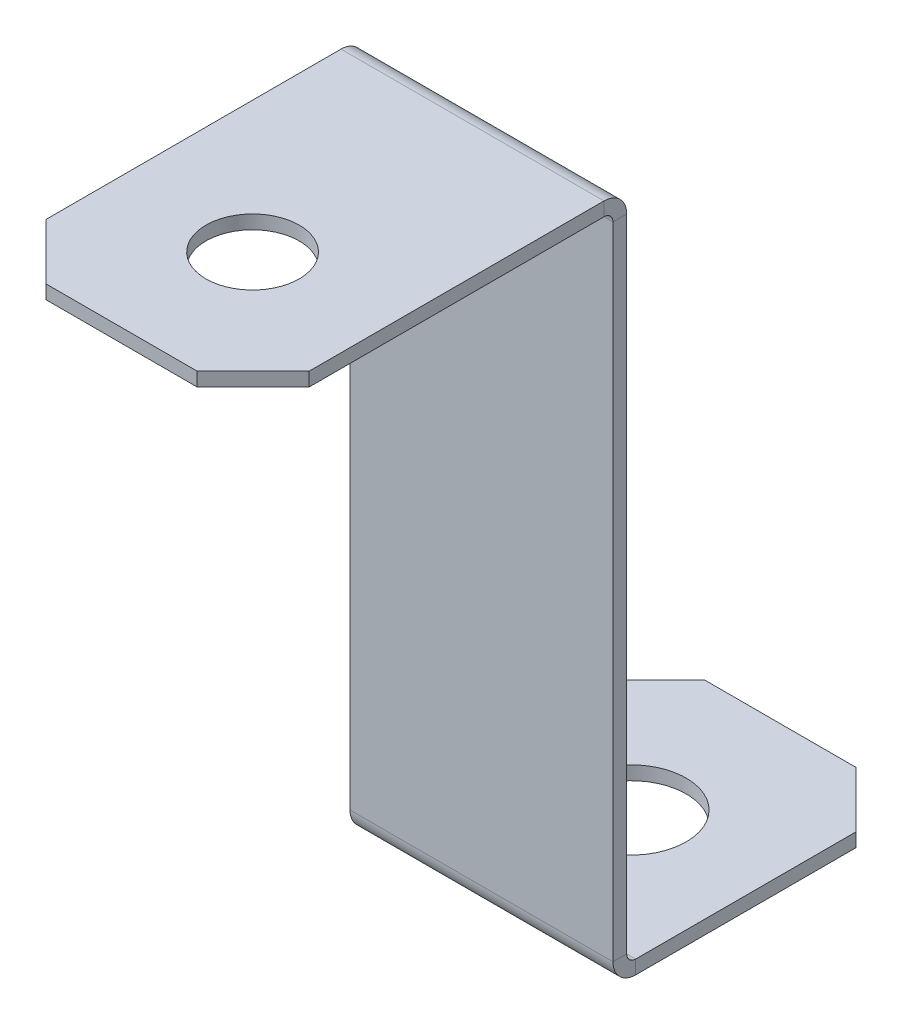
ISO-10303-21;
HEADER;
FILE_DESCRIPTION(('STEP AP214'),'2;1');
FILE_NAME('part.step','',(''),(''),'','','');
FILE_SCHEMA(('AUTOMOTIVE_DESIGN { 1 0 10303 214 1 1 1 1 }'));
ENDSEC;
DATA;
#1=APPLICATION_CONTEXT('core data for automotive mechanical design processes');
#2=APPLICATION_PROTOCOL_DEFINITION('international standard','automotive_design',2000,#1);
#3=PRODUCT_CONTEXT('',#1,'mechanical');
#4=PRODUCT('Part','Part','',(#3));
#5=PRODUCT_RELATED_PRODUCT_CATEGORY('part','',(#4));
#6=PRODUCT_DEFINITION_FORMATION('','',#4);
#7=PRODUCT_DEFINITION_CONTEXT('part definition',#1,'design');
#8=PRODUCT_DEFINITION('design','',#6,#7);
#9=PRODUCT_DEFINITION_SHAPE('','',#8);
#10=(LENGTH_UNIT() NAMED_UNIT(*) SI_UNIT(.MILLI.,.METRE.));
#11=(NAMED_UNIT(*) PLANE_ANGLE_UNIT() SI_UNIT($,.RADIAN.));
#12=(NAMED_UNIT(*) SI_UNIT($,.STERADIAN.) SOLID_ANGLE_UNIT());
#13=UNCERTAINTY_MEASURE_WITH_UNIT(LENGTH_MEASURE(1.E-05),#10,'distance_accuracy_value','');
#14=(GEOMETRIC_REPRESENTATION_CONTEXT(3) GLOBAL_UNCERTAINTY_ASSIGNED_CONTEXT((#13)) GLOBAL_UNIT_ASSIGNED_CONTEXT((#10,
#11,#12)) REPRESENTATION_CONTEXT('',''));
#15=CARTESIAN_POINT('',(0.,0.,0.));
#16=DIRECTION('',(0.,0.,1.));
#17=DIRECTION('',(1.,0.,0.));
#18=AXIS2_PLACEMENT_3D('',#15,#16,#17);
#19=CARTESIAN_POINT('',(5.588,-0.9652,-10.3124));
#20=DIRECTION('',(1.,0.,0.));
#21=DIRECTION('',(0.,0.,-1.));
#22=AXIS2_PLACEMENT_3D('',#19,#20,#21);
#23=PLANE('',#22);
#24=DIRECTION('',(0.,0.,1.));
#25=VECTOR('',#24,1.);
#26=CARTESIAN_POINT('',(5.588,-0.9652,-10.3124));
#27=LINE('',#26,#25);
#28=CARTESIAN_POINT('',(5.588,-0.9652,-10.3124));
#29=VERTEX_POINT('',#28);
#30=CARTESIAN_POINT('',(5.588,-0.9652,-9.7282));
#31=VERTEX_POINT('',#30);
#32=EDGE_CURVE('E270',#29,#31,#27,.T.);
#33=ORIENTED_EDGE('',*,*,#32,.F.);
#34=CARTESIAN_POINT('',(5.588,-0.9652,-9.3472));
#35=DIRECTION('',(1.,0.,0.));
#36=DIRECTION('',(0.,0.,-1.));
#37=AXIS2_PLACEMENT_3D('',#34,#35,#36);
#38=CIRCLE('',#37,0.9652);
#39=CARTESIAN_POINT('',(5.588,0.,-9.3472));
#40=VERTEX_POINT('',#39);
#41=EDGE_CURVE('E187',#40,#29,#38,.F.);
#42=ORIENTED_EDGE('',*,*,#41,.F.);
#43=DIRECTION('',(0.,1.,0.));
#44=VECTOR('',#43,1.);
#45=CARTESIAN_POINT('',(5.588,-0.5842,-9.3472));
#46=LINE('',#45,#44);
#47=CARTESIAN_POINT('',(5.588,-0.5842,-9.3472));
#48=VERTEX_POINT('',#47);
#49=EDGE_CURVE('E267',#48,#40,#46,.T.);
#50=ORIENTED_EDGE('',*,*,#49,.F.);
#51=CARTESIAN_POINT('',(5.588,-0.9652,-9.3472));
#52=DIRECTION('',(1.,0.,0.));
#53=DIRECTION('',(0.,0.,-1.));
#54=AXIS2_PLACEMENT_3D('',#51,#52,#53);
#55=CIRCLE('',#54,0.381);
#56=EDGE_CURVE('E197',#48,#31,#55,.F.);
#57=ORIENTED_EDGE('',*,*,#56,.T.);
#58=EDGE_LOOP('',(#33,#42,#50,#57));
#59=FACE_BOUND('',#58,.T.);
#60=ADVANCED_FACE('F37',(#59),#23,.T.);
#61=CARTESIAN_POINT('',(5.588,-0.5842,-9.3472));
#62=DIRECTION('',(1.,0.,0.));
#63=DIRECTION('',(0.,0.,-1.));
#64=AXIS2_PLACEMENT_3D('',#61,#62,#63);
#65=PLANE('',#64);
#66=DIRECTION('',(0.,-1.,0.));
#67=VECTOR('',#66,1.);
#68=CARTESIAN_POINT('',(5.588,0.,-10.3124));
#69=LINE('',#68,#67);
#70=CARTESIAN_POINT('',(5.588,-28.194,-10.3124));
#71=VERTEX_POINT('',#70);
#72=EDGE_CURVE('E185',#29,#71,#69,.T.);
#73=ORIENTED_EDGE('',*,*,#72,.F.);
#74=ORIENTED_EDGE('',*,*,#32,.T.);
#75=DIRECTION('',(0.,-1.,0.));
#76=VECTOR('',#75,1.);
#77=CARTESIAN_POINT('',(5.588,0.,-9.7282));
#78=LINE('',#77,#76);
#79=CARTESIAN_POINT('',(5.588,-28.194,-9.7282));
#80=VERTEX_POINT('',#79);
#81=EDGE_CURVE('E200',#31,#80,#78,.T.);
#82=ORIENTED_EDGE('',*,*,#81,.T.);
#83=DIRECTION('',(0.,0.,-1.));
#84=VECTOR('',#83,1.);
#85=CARTESIAN_POINT('',(5.588,-28.194,-9.7282));
#86=LINE('',#85,#84);
#87=EDGE_CURVE('E162',#80,#71,#86,.T.);
#88=ORIENTED_EDGE('',*,*,#87,.T.);
#89=EDGE_LOOP('',(#73,#74,#82,#88));
#90=FACE_BOUND('',#89,.T.);
#91=ADVANCED_FACE('F347',(#90),#65,.T.);
#92=CARTESIAN_POINT('',(-5.588,0.,-9.3472));
#93=DIRECTION('',(-1.,0.,0.));
#94=DIRECTION('',(0.,0.,1.));
#95=AXIS2_PLACEMENT_3D('',#92,#93,#94);
#96=PLANE('',#95);
#97=DIRECTION('',(0.,-1.,0.));
#98=VECTOR('',#97,1.);
#99=CARTESIAN_POINT('',(-5.588,0.,-9.3472));
#100=LINE('',#99,#98);
#101=CARTESIAN_POINT('',(-5.588,0.,-9.3472));
#102=VERTEX_POINT('',#101);
#103=CARTESIAN_POINT('',(-5.588,-0.5842,-9.3472));
#104=VERTEX_POINT('',#103);
#105=EDGE_CURVE('E264',#102,#104,#100,.T.);
#106=ORIENTED_EDGE('',*,*,#105,.F.);
#107=CARTESIAN_POINT('',(-5.588,-0.9652,-9.3472));
#108=DIRECTION('',(1.,0.,0.));
#109=DIRECTION('',(0.,0.,-1.));
#110=AXIS2_PLACEMENT_3D('',#107,#108,#109);
#111=CIRCLE('',#110,0.9652);
#112=CARTESIAN_POINT('',(-5.588,-0.9652,-10.3124));
#113=VERTEX_POINT('',#112);
#114=EDGE_CURVE('E215',#102,#113,#111,.F.);
#115=ORIENTED_EDGE('',*,*,#114,.T.);
#116=DIRECTION('',(0.,0.,-1.));
#117=VECTOR('',#116,1.);
#118=CARTESIAN_POINT('',(-5.588,-0.9652,-9.7282));
#119=LINE('',#118,#117);
#120=CARTESIAN_POINT('',(-5.588,-0.9652,-9.7282));
#121=VERTEX_POINT('',#120);
#122=EDGE_CURVE('E161',#121,#113,#119,.T.);
#123=ORIENTED_EDGE('',*,*,#122,.F.);
#124=CARTESIAN_POINT('',(-5.588,-0.9652,-9.3472));
#125=DIRECTION('',(1.,0.,0.));
#126=DIRECTION('',(0.,0.,-1.));
#127=AXIS2_PLACEMENT_3D('',#124,#125,#126);
#128=CIRCLE('',#127,0.381);
#129=EDGE_CURVE('E222',#104,#121,#128,.F.);
#130=ORIENTED_EDGE('',*,*,#129,.F.);
#131=EDGE_LOOP('',(#106,#115,#123,#130));
#132=FACE_BOUND('',#131,.T.);
#133=ADVANCED_FACE('F353',(#132),#96,.T.);
#134=CARTESIAN_POINT('',(-5.588,-0.9652,-9.7282));
#135=DIRECTION('',(-1.,0.,0.));
#136=DIRECTION('',(0.,0.,1.));
#137=AXIS2_PLACEMENT_3D('',#134,#135,#136);
#138=PLANE('',#137);
#139=DIRECTION('',(0.,0.,-1.));
#140=VECTOR('',#139,1.);
#141=CARTESIAN_POINT('',(-5.588,-0.5842,5.5626));
#142=LINE('',#141,#140);
#143=CARTESIAN_POINT('',(-5.588,-0.5842,3.18135000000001));
#144=VERTEX_POINT('',#143);
#145=EDGE_CURVE('E220',#144,#104,#142,.T.);
#146=ORIENTED_EDGE('',*,*,#145,.F.);
#147=DIRECTION('',(0.,1.,0.));
#148=VECTOR('',#147,1.);
#149=CARTESIAN_POINT('',(-5.588,-0.9652,3.18135000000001));
#150=LINE('',#149,#148);
#151=CARTESIAN_POINT('',(-5.588,0.,3.18135000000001));
#152=VERTEX_POINT('',#151);
#153=EDGE_CURVE('E272',#144,#152,#150,.T.);
#154=ORIENTED_EDGE('',*,*,#153,.T.);
#155=DIRECTION('',(0.,0.,-1.));
#156=VECTOR('',#155,1.);
#157=CARTESIAN_POINT('',(-5.588,0.,5.5626));
#158=LINE('',#157,#156);
#159=EDGE_CURVE('E218',#152,#102,#158,.T.);
#160=ORIENTED_EDGE('',*,*,#159,.T.);
#161=ORIENTED_EDGE('',*,*,#105,.T.);
#162=EDGE_LOOP('',(#146,#154,#160,#161));
#163=FACE_BOUND('',#162,.T.);
#164=ADVANCED_FACE('F451',(#163),#138,.T.);
#165=CARTESIAN_POINT('',(5.588,-28.575,-10.6934));
#166=DIRECTION('',(1.,0.,0.));
#167=DIRECTION('',(0.,0.,-1.));
#168=AXIS2_PLACEMENT_3D('',#165,#166,#167);
#169=PLANE('',#168);
#170=DIRECTION('',(0.,-1.,0.));
#171=VECTOR('',#170,1.);
#172=CARTESIAN_POINT('',(5.588,-28.575,-10.6934));
#173=LINE('',#172,#171);
#174=CARTESIAN_POINT('',(5.588,-28.575,-10.6934));
#175=VERTEX_POINT('',#174);
#176=CARTESIAN_POINT('',(5.588,-29.1592,-10.6934));
#177=VERTEX_POINT('',#176);
#178=EDGE_CURVE('E152',#175,#177,#173,.T.);
#179=ORIENTED_EDGE('',*,*,#178,.F.);
#180=CARTESIAN_POINT('',(5.588,-28.194,-10.6934));
#181=DIRECTION('',(-1.,0.,0.));
#182=DIRECTION('',(0.,0.,1.));
#183=AXIS2_PLACEMENT_3D('',#180,#181,#182);
#184=CIRCLE('',#183,0.381);
#185=EDGE_CURVE('E156',#71,#175,#184,.F.);
#186=ORIENTED_EDGE('',*,*,#185,.F.);
#187=ORIENTED_EDGE('',*,*,#87,.F.);
#188=CARTESIAN_POINT('',(5.588,-28.194,-10.6934));
#189=DIRECTION('',(1.,0.,0.));
#190=DIRECTION('',(0.,0.,-1.));
#191=AXIS2_PLACEMENT_3D('',#188,#189,#190);
#192=CIRCLE('',#191,0.9652);
#193=EDGE_CURVE('E159',#80,#177,#192,.T.);
#194=ORIENTED_EDGE('',*,*,#193,.T.);
#195=EDGE_LOOP('',(#179,#186,#187,#194));
#196=FACE_BOUND('',#195,.T.);
#197=ADVANCED_FACE('F154',(#196),#169,.T.);
#198=CARTESIAN_POINT('',(5.588,-28.194,-9.7282));
#199=DIRECTION('',(1.,0.,0.));
#200=DIRECTION('',(0.,0.,-1.));
#201=AXIS2_PLACEMENT_3D('',#198,#199,#200);
#202=PLANE('',#201);
#203=DIRECTION('',(0.,0.,-1.));
#204=VECTOR('',#203,1.);
#205=CARTESIAN_POINT('',(5.588,-29.1592,-10.3124));
#206=LINE('',#205,#204);
#207=CARTESIAN_POINT('',(5.588,-29.1592,-20.04695));
#208=VERTEX_POINT('',#207);
#209=EDGE_CURVE('E180',#177,#208,#206,.T.);
#210=ORIENTED_EDGE('',*,*,#209,.T.);
#211=DIRECTION('',(0.,1.,0.));
#212=VECTOR('',#211,1.);
#213=CARTESIAN_POINT('',(5.588,-28.194,-20.04695));
#214=LINE('',#213,#212);
#215=CARTESIAN_POINT('',(5.588,-28.575,-20.04695));
#216=VERTEX_POINT('',#215);
#217=EDGE_CURVE('E11',#208,#216,#214,.T.);
#218=ORIENTED_EDGE('',*,*,#217,.T.);
#219=DIRECTION('',(0.,0.,-1.));
#220=VECTOR('',#219,1.);
#221=CARTESIAN_POINT('',(5.588,-28.575,-10.3124));
#222=LINE('',#221,#220);
#223=EDGE_CURVE('E169',#175,#216,#222,.T.);
#224=ORIENTED_EDGE('',*,*,#223,.F.);
#225=ORIENTED_EDGE('',*,*,#178,.T.);
#226=EDGE_LOOP('',(#210,#218,#224,#225));
#227=FACE_BOUND('',#226,.T.);
#228=ADVANCED_FACE('F179',(#227),#202,.T.);
#229=CARTESIAN_POINT('',(-5.588,-28.194,-10.3124));
#230=DIRECTION('',(-1.,0.,0.));
#231=DIRECTION('',(0.,0.,1.));
#232=AXIS2_PLACEMENT_3D('',#229,#230,#231);
#233=PLANE('',#232);
#234=DIRECTION('',(0.,0.,1.));
#235=VECTOR('',#234,1.);
#236=CARTESIAN_POINT('',(-5.588,-28.194,-10.3124));
#237=LINE('',#236,#235);
#238=CARTESIAN_POINT('',(-5.588,-28.194,-10.3124));
#239=VERTEX_POINT('',#238);
#240=CARTESIAN_POINT('',(-5.588,-28.194,-9.7282));
#241=VERTEX_POINT('',#240);
#242=EDGE_CURVE('E260',#239,#241,#237,.T.);
#243=ORIENTED_EDGE('',*,*,#242,.F.);
#244=CARTESIAN_POINT('',(-5.588,-28.194,-10.6934));
#245=DIRECTION('',(-1.,0.,0.));
#246=DIRECTION('',(0.,0.,1.));
#247=AXIS2_PLACEMENT_3D('',#244,#245,#246);
#248=CIRCLE('',#247,0.381);
#249=CARTESIAN_POINT('',(-5.588,-28.575,-10.6934));
#250=VERTEX_POINT('',#249);
#251=EDGE_CURVE('E210',#239,#250,#248,.F.);
#252=ORIENTED_EDGE('',*,*,#251,.T.);
#253=DIRECTION('',(0.,1.,0.));
#254=VECTOR('',#253,1.);
#255=CARTESIAN_POINT('',(-5.588,-29.1592,-10.6934));
#256=LINE('',#255,#254);
#257=CARTESIAN_POINT('',(-5.588,-29.1592,-10.6934));
#258=VERTEX_POINT('',#257);
#259=EDGE_CURVE('E258',#258,#250,#256,.T.);
#260=ORIENTED_EDGE('',*,*,#259,.F.);
#261=CARTESIAN_POINT('',(-5.588,-28.194,-10.6934));
#262=DIRECTION('',(1.,0.,0.));
#263=DIRECTION('',(0.,0.,-1.));
#264=AXIS2_PLACEMENT_3D('',#261,#262,#263);
#265=CIRCLE('',#264,0.9652);
#266=EDGE_CURVE('E228',#241,#258,#265,.T.);
#267=ORIENTED_EDGE('',*,*,#266,.F.);
#268=EDGE_LOOP('',(#243,#252,#260,#267));
#269=FACE_BOUND('',#268,.T.);
#270=ADVANCED_FACE('F436',(#269),#233,.T.);
#271=CARTESIAN_POINT('',(-5.588,-29.1592,-10.6934));
#272=DIRECTION('',(-1.,0.,0.));
#273=DIRECTION('',(0.,0.,1.));
#274=AXIS2_PLACEMENT_3D('',#271,#272,#273);
#275=PLANE('',#274);
#276=DIRECTION('',(0.,-1.,0.));
#277=VECTOR('',#276,1.);
#278=CARTESIAN_POINT('',(-5.588,0.,-10.3124));
#279=LINE('',#278,#277);
#280=EDGE_CURVE('E212',#113,#239,#279,.T.);
#281=ORIENTED_EDGE('',*,*,#280,.T.);
#282=ORIENTED_EDGE('',*,*,#242,.T.);
#283=DIRECTION('',(0.,-1.,0.));
#284=VECTOR('',#283,1.);
#285=CARTESIAN_POINT('',(-5.588,0.,-9.7282));
#286=LINE('',#285,#284);
#287=EDGE_CURVE('E225',#121,#241,#286,.T.);
#288=ORIENTED_EDGE('',*,*,#287,.F.);
#289=ORIENTED_EDGE('',*,*,#122,.T.);
#290=EDGE_LOOP('',(#281,#282,#288,#289));
#291=FACE_BOUND('',#290,.T.);
#292=ADVANCED_FACE('F437',(#291),#275,.T.);
#293=CARTESIAN_POINT('',(5.588,-29.1592,-10.3124));
#294=DIRECTION('',(0.,1.,0.));
#295=DIRECTION('',(0.,0.,1.));
#296=AXIS2_PLACEMENT_3D('',#293,#294,#295);
#297=PLANE('',#296);
#298=CARTESIAN_POINT('',(0.,-29.1592,-16.0782));
#299=DIRECTION('',(0.,1.,0.));
#300=DIRECTION('',(0.,0.,1.));
#301=AXIS2_PLACEMENT_3D('',#298,#299,#300);
#302=CIRCLE('',#301,2.3495);
#303=CARTESIAN_POINT('',(0.,-29.1592,-13.7287));
#304=VERTEX_POINT('',#303);
#305=EDGE_CURVE('E320',#304,#304,#302,.T.);
#306=ORIENTED_EDGE('',*,*,#305,.T.);
#307=EDGE_LOOP('',(#306));
#308=FACE_BOUND('',#307,.T.);
#309=DIRECTION('',(0.,0.,-1.));
#310=VECTOR('',#309,1.);
#311=CARTESIAN_POINT('',(-5.588,-29.1592,-10.3124));
#312=LINE('',#311,#310);
#313=CARTESIAN_POINT('',(-5.588,-29.1592,-20.04695));
#314=VERTEX_POINT('',#313);
#315=EDGE_CURVE('E205',#258,#314,#312,.T.);
#316=ORIENTED_EDGE('',*,*,#315,.T.);
#317=DIRECTION('',(-0.707106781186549,0.,0.707106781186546));
#318=VECTOR('',#317,1.);
#319=CARTESIAN_POINT('',(-5.588,-29.1592,-20.04695));
#320=LINE('',#319,#318);
#321=CARTESIAN_POINT('',(-3.20675,-29.1592,-22.4282));
#322=VERTEX_POINT('',#321);
#323=EDGE_CURVE('E295',#314,#322,#320,.F.);
#324=ORIENTED_EDGE('',*,*,#323,.T.);
#325=DIRECTION('',(-1.,0.,0.));
#326=VECTOR('',#325,1.);
#327=CARTESIAN_POINT('',(5.588,-29.1592,-22.4282));
#328=LINE('',#327,#326);
#329=CARTESIAN_POINT('',(3.20675,-29.1592,-22.4282));
#330=VERTEX_POINT('',#329);
#331=EDGE_CURVE('E256',#330,#322,#328,.T.);
#332=ORIENTED_EDGE('',*,*,#331,.F.);
#333=DIRECTION('',(-0.707106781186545,0.,-0.70710678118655));
#334=VECTOR('',#333,1.);
#335=CARTESIAN_POINT('',(3.20675,-29.1592,-22.4282));
#336=LINE('',#335,#334);
#337=EDGE_CURVE('E293',#330,#208,#336,.F.);
#338=ORIENTED_EDGE('',*,*,#337,.T.);
#339=ORIENTED_EDGE('',*,*,#209,.F.);
#340=DIRECTION('',(-1.,0.,0.));
#341=VECTOR('',#340,1.);
#342=CARTESIAN_POINT('',(5.588,-29.1592,-10.6934));
#343=LINE('',#342,#341);
#344=EDGE_CURVE('E204',#177,#258,#343,.T.);
#345=ORIENTED_EDGE('',*,*,#344,.T.);
#346=EDGE_LOOP('',(#316,#324,#332,#338,#339,#345));
#347=FACE_BOUND('',#346,.T.);
#348=ADVANCED_FACE('F311',(#308,#347),#297,.F.);
#349=CARTESIAN_POINT('',(5.588,-28.575,-22.4282));
#350=DIRECTION('',(0.,0.,-1.));
#351=DIRECTION('',(-1.,0.,0.));
#352=AXIS2_PLACEMENT_3D('',#349,#350,#351);
#353=PLANE('',#352);
#354=ORIENTED_EDGE('',*,*,#331,.T.);
#355=DIRECTION('',(0.,1.,0.));
#356=VECTOR('',#355,1.);
#357=CARTESIAN_POINT('',(-3.20675,-28.575,-22.4282));
#358=LINE('',#357,#356);
#359=CARTESIAN_POINT('',(-3.20675,-28.575,-22.4282));
#360=VERTEX_POINT('',#359);
#361=EDGE_CURVE('E58',#322,#360,#358,.T.);
#362=ORIENTED_EDGE('',*,*,#361,.T.);
#363=DIRECTION('',(-1.,0.,0.));
#364=VECTOR('',#363,1.);
#365=CARTESIAN_POINT('',(5.588,-28.575,-22.4282));
#366=LINE('',#365,#364);
#367=CARTESIAN_POINT('',(3.20675,-28.575,-22.4282));
#368=VERTEX_POINT('',#367);
#369=EDGE_CURVE('E176',#368,#360,#366,.T.);
#370=ORIENTED_EDGE('',*,*,#369,.F.);
#371=DIRECTION('',(0.,-1.,0.));
#372=VECTOR('',#371,1.);
#373=CARTESIAN_POINT('',(3.20675,-28.575,-22.4282));
#374=LINE('',#373,#372);
#375=EDGE_CURVE('E297',#368,#330,#374,.T.);
#376=ORIENTED_EDGE('',*,*,#375,.T.);
#377=EDGE_LOOP('',(#354,#362,#370,#376));
#378=FACE_BOUND('',#377,.T.);
#379=ADVANCED_FACE('F312',(#378),#353,.T.);
#380=CARTESIAN_POINT('',(5.588,-28.575,-10.3124));
#381=DIRECTION('',(0.,1.,0.));
#382=DIRECTION('',(0.,0.,1.));
#383=AXIS2_PLACEMENT_3D('',#380,#381,#382);
#384=PLANE('',#383);
#385=CARTESIAN_POINT('',(0.,-28.575,-16.0782));
#386=DIRECTION('',(0.,1.,0.));
#387=DIRECTION('',(0.,0.,1.));
#388=AXIS2_PLACEMENT_3D('',#385,#386,#387);
#389=CIRCLE('',#388,2.3495);
#390=CARTESIAN_POINT('',(0.,-28.575,-13.7287));
#391=VERTEX_POINT('',#390);
#392=EDGE_CURVE('E323',#391,#391,#389,.T.);
#393=ORIENTED_EDGE('',*,*,#392,.F.);
#394=EDGE_LOOP('',(#393));
#395=FACE_BOUND('',#394,.T.);
#396=ORIENTED_EDGE('',*,*,#369,.T.);
#397=DIRECTION('',(0.707106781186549,0.,-0.707106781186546));
#398=VECTOR('',#397,1.);
#399=CARTESIAN_POINT('',(-4.86727499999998,-28.575,-20.767675));
#400=LINE('',#399,#398);
#401=CARTESIAN_POINT('',(-5.588,-28.575,-20.04695));
#402=VERTEX_POINT('',#401);
#403=EDGE_CURVE('E45',#360,#402,#400,.F.);
#404=ORIENTED_EDGE('',*,*,#403,.T.);
#405=DIRECTION('',(0.,0.,-1.));
#406=VECTOR('',#405,1.);
#407=CARTESIAN_POINT('',(-5.588,-28.575,-10.3124));
#408=LINE('',#407,#406);
#409=EDGE_CURVE('E172',#250,#402,#408,.T.);
#410=ORIENTED_EDGE('',*,*,#409,.F.);
#411=DIRECTION('',(-1.,0.,0.));
#412=VECTOR('',#411,1.);
#413=CARTESIAN_POINT('',(5.588,-28.575,-10.6934));
#414=LINE('',#413,#412);
#415=EDGE_CURVE('E167',#175,#250,#414,.T.);
#416=ORIENTED_EDGE('',*,*,#415,.F.);
#417=ORIENTED_EDGE('',*,*,#223,.T.);
#418=DIRECTION('',(0.707106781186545,0.,0.70710678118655));
#419=VECTOR('',#418,1.);
#420=CARTESIAN_POINT('',(10.455275,-28.575,-15.179675));
#421=LINE('',#420,#419);
#422=EDGE_CURVE('E301',#216,#368,#421,.F.);
#423=ORIENTED_EDGE('',*,*,#422,.T.);
#424=EDGE_LOOP('',(#396,#404,#410,#416,#417,#423));
#425=FACE_BOUND('',#424,.T.);
#426=ADVANCED_FACE('F168',(#395,#425),#384,.T.);
#427=CARTESIAN_POINT('',(5.588,-28.194,-10.6934));
#428=DIRECTION('',(-1.,0.,0.));
#429=DIRECTION('',(0.,0.,1.));
#430=AXIS2_PLACEMENT_3D('',#427,#428,#429);
#431=CYLINDRICAL_SURFACE('',#430,0.381);
#432=ORIENTED_EDGE('',*,*,#251,.F.);
#433=DIRECTION('',(-1.,0.,0.));
#434=VECTOR('',#433,1.);
#435=CARTESIAN_POINT('',(5.588,-28.194,-10.3124));
#436=LINE('',#435,#434);
#437=EDGE_CURVE('E177',#71,#239,#436,.T.);
#438=ORIENTED_EDGE('',*,*,#437,.F.);
#439=ORIENTED_EDGE('',*,*,#185,.T.);
#440=ORIENTED_EDGE('',*,*,#415,.T.);
#441=EDGE_LOOP('',(#432,#438,#439,#440));
#442=FACE_BOUND('',#441,.T.);
#443=ADVANCED_FACE('F183',(#442),#431,.F.);
#444=CARTESIAN_POINT('',(5.588,0.,-10.3124));
#445=DIRECTION('',(0.,0.,-1.));
#446=DIRECTION('',(0.,1.,0.));
#447=AXIS2_PLACEMENT_3D('',#444,#445,#446);
#448=PLANE('',#447);
#449=ORIENTED_EDGE('',*,*,#280,.F.);
#450=DIRECTION('',(-1.,0.,0.));
#451=VECTOR('',#450,1.);
#452=CARTESIAN_POINT('',(5.588,-0.9652,-10.3124));
#453=LINE('',#452,#451);
#454=EDGE_CURVE('E251',#29,#113,#453,.T.);
#455=ORIENTED_EDGE('',*,*,#454,.F.);
#456=ORIENTED_EDGE('',*,*,#72,.T.);
#457=ORIENTED_EDGE('',*,*,#437,.T.);
#458=EDGE_LOOP('',(#449,#455,#456,#457));
#459=FACE_BOUND('',#458,.T.);
#460=ADVANCED_FACE('F343',(#459),#448,.T.);
#461=CARTESIAN_POINT('',(5.588,-0.9652,-9.3472));
#462=DIRECTION('',(-1.,0.,0.));
#463=DIRECTION('',(0.,0.,1.));
#464=AXIS2_PLACEMENT_3D('',#461,#462,#463);
#465=CYLINDRICAL_SURFACE('',#464,0.9652);
#466=ORIENTED_EDGE('',*,*,#114,.F.);
#467=DIRECTION('',(-1.,0.,0.));
#468=VECTOR('',#467,1.);
#469=CARTESIAN_POINT('',(5.588,0.,-9.3472));
#470=LINE('',#469,#468);
#471=EDGE_CURVE('E248',#40,#102,#470,.T.);
#472=ORIENTED_EDGE('',*,*,#471,.F.);
#473=ORIENTED_EDGE('',*,*,#41,.T.);
#474=ORIENTED_EDGE('',*,*,#454,.T.);
#475=EDGE_LOOP('',(#466,#472,#473,#474));
#476=FACE_BOUND('',#475,.T.);
#477=ADVANCED_FACE('F408',(#476),#465,.T.);
#478=CARTESIAN_POINT('',(5.588,0.,5.5626));
#479=DIRECTION('',(0.,1.,0.));
#480=DIRECTION('',(0.,0.,1.));
#481=AXIS2_PLACEMENT_3D('',#478,#479,#480);
#482=PLANE('',#481);
#483=CARTESIAN_POINT('',(0.,0.,0.));
#484=DIRECTION('',(0.,1.,0.));
#485=DIRECTION('',(0.,0.,1.));
#486=AXIS2_PLACEMENT_3D('',#483,#484,#485);
#487=CIRCLE('',#486,1.9812);
#488=CARTESIAN_POINT('',(0.,0.,1.9812));
#489=VERTEX_POINT('',#488);
#490=EDGE_CURVE('E317',#489,#489,#487,.T.);
#491=ORIENTED_EDGE('',*,*,#490,.F.);
#492=EDGE_LOOP('',(#491));
#493=FACE_BOUND('',#492,.T.);
#494=ORIENTED_EDGE('',*,*,#159,.F.);
#495=DIRECTION('',(-0.70710678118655,0.,-0.707106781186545));
#496=VECTOR('',#495,1.);
#497=CARTESIAN_POINT('',(1.19062500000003,0.,9.959975));
#498=LINE('',#497,#496);
#499=CARTESIAN_POINT('',(-3.20674999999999,0.,5.5626));
#500=VERTEX_POINT('',#499);
#501=EDGE_CURVE('E277',#152,#500,#498,.F.);
#502=ORIENTED_EDGE('',*,*,#501,.T.);
#503=DIRECTION('',(-1.,0.,0.));
#504=VECTOR('',#503,1.);
#505=CARTESIAN_POINT('',(5.588,0.,5.5626));
#506=LINE('',#505,#504);
#507=CARTESIAN_POINT('',(3.20675,0.,5.5626));
#508=VERTEX_POINT('',#507);
#509=EDGE_CURVE('E245',#508,#500,#506,.T.);
#510=ORIENTED_EDGE('',*,*,#509,.F.);
#511=DIRECTION('',(0.707106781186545,0.,-0.70710678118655));
#512=VECTOR('',#511,1.);
#513=CARTESIAN_POINT('',(4.39737499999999,0.,4.371975));
#514=LINE('',#513,#512);
#515=CARTESIAN_POINT('',(5.588,0.,3.18134999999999));
#516=VERTEX_POINT('',#515);
#517=EDGE_CURVE('E275',#508,#516,#514,.T.);
#518=ORIENTED_EDGE('',*,*,#517,.T.);
#519=DIRECTION('',(0.,0.,-1.));
#520=VECTOR('',#519,1.);
#521=CARTESIAN_POINT('',(5.588,0.,5.5626));
#522=LINE('',#521,#520);
#523=EDGE_CURVE('E193',#516,#40,#522,.T.);
#524=ORIENTED_EDGE('',*,*,#523,.T.);
#525=ORIENTED_EDGE('',*,*,#471,.T.);
#526=EDGE_LOOP('',(#494,#502,#510,#518,#524,#525));
#527=FACE_BOUND('',#526,.T.);
#528=ADVANCED_FACE('F404',(#493,#527),#482,.T.);
#529=CARTESIAN_POINT('',(5.588,-0.5842,5.5626));
#530=DIRECTION('',(0.,0.,1.));
#531=DIRECTION('',(1.,0.,0.));
#532=AXIS2_PLACEMENT_3D('',#529,#530,#531);
#533=PLANE('',#532);
#534=ORIENTED_EDGE('',*,*,#509,.T.);
#535=DIRECTION('',(0.,-1.,0.));
#536=VECTOR('',#535,1.);
#537=CARTESIAN_POINT('',(-3.20674999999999,-0.5842,5.5626));
#538=LINE('',#537,#536);
#539=CARTESIAN_POINT('',(-3.20674999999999,-0.5842,5.5626));
#540=VERTEX_POINT('',#539);
#541=EDGE_CURVE('E282',#500,#540,#538,.T.);
#542=ORIENTED_EDGE('',*,*,#541,.T.);
#543=DIRECTION('',(-1.,0.,0.));
#544=VECTOR('',#543,1.);
#545=CARTESIAN_POINT('',(5.588,-0.5842,5.5626));
#546=LINE('',#545,#544);
#547=CARTESIAN_POINT('',(3.20675,-0.5842,5.5626));
#548=VERTEX_POINT('',#547);
#549=EDGE_CURVE('E242',#548,#540,#546,.T.);
#550=ORIENTED_EDGE('',*,*,#549,.F.);
#551=DIRECTION('',(0.,1.,0.));
#552=VECTOR('',#551,1.);
#553=CARTESIAN_POINT('',(3.20675,0.,5.5626));
#554=LINE('',#553,#552);
#555=EDGE_CURVE('E279',#548,#508,#554,.T.);
#556=ORIENTED_EDGE('',*,*,#555,.T.);
#557=EDGE_LOOP('',(#534,#542,#550,#556));
#558=FACE_BOUND('',#557,.T.);
#559=ADVANCED_FACE('F400',(#558),#533,.T.);
#560=CARTESIAN_POINT('',(5.588,-0.5842,5.5626));
#561=DIRECTION('',(0.,1.,0.));
#562=DIRECTION('',(0.,0.,1.));
#563=AXIS2_PLACEMENT_3D('',#560,#561,#562);
#564=PLANE('',#563);
#565=CARTESIAN_POINT('',(0.,-0.5842,0.));
#566=DIRECTION('',(0.,1.,0.));
#567=DIRECTION('',(0.,0.,1.));
#568=AXIS2_PLACEMENT_3D('',#565,#566,#567);
#569=CIRCLE('',#568,1.9812);
#570=CARTESIAN_POINT('',(0.,-0.5842,1.9812));
#571=VERTEX_POINT('',#570);
#572=EDGE_CURVE('E208',#571,#571,#569,.T.);
#573=ORIENTED_EDGE('',*,*,#572,.T.);
#574=EDGE_LOOP('',(#573));
#575=FACE_BOUND('',#574,.T.);
#576=ORIENTED_EDGE('',*,*,#549,.T.);
#577=DIRECTION('',(0.70710678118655,0.,0.707106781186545));
#578=VECTOR('',#577,1.);
#579=CARTESIAN_POINT('',(-5.588,-0.5842,3.18135000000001));
#580=LINE('',#579,#578);
#581=EDGE_CURVE('E286',#540,#144,#580,.F.);
#582=ORIENTED_EDGE('',*,*,#581,.T.);
#583=ORIENTED_EDGE('',*,*,#145,.T.);
#584=DIRECTION('',(-1.,0.,0.));
#585=VECTOR('',#584,1.);
#586=CARTESIAN_POINT('',(5.588,-0.5842,-9.3472));
#587=LINE('',#586,#585);
#588=EDGE_CURVE('E239',#48,#104,#587,.T.);
#589=ORIENTED_EDGE('',*,*,#588,.F.);
#590=DIRECTION('',(0.,0.,-1.));
#591=VECTOR('',#590,1.);
#592=CARTESIAN_POINT('',(5.588,-0.5842,5.5626));
#593=LINE('',#592,#591);
#594=CARTESIAN_POINT('',(5.588,-0.5842,3.18134999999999));
#595=VERTEX_POINT('',#594);
#596=EDGE_CURVE('E195',#595,#48,#593,.T.);
#597=ORIENTED_EDGE('',*,*,#596,.F.);
#598=DIRECTION('',(-0.707106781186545,0.,0.70710678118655));
#599=VECTOR('',#598,1.);
#600=CARTESIAN_POINT('',(3.20675,-0.5842,5.5626));
#601=LINE('',#600,#599);
#602=EDGE_CURVE('E284',#595,#548,#601,.T.);
#603=ORIENTED_EDGE('',*,*,#602,.T.);
#604=EDGE_LOOP('',(#576,#582,#583,#589,#597,#603));
#605=FACE_BOUND('',#604,.T.);
#606=ADVANCED_FACE('F396',(#575,#605),#564,.F.);
#607=CARTESIAN_POINT('',(5.588,-0.9652,-9.3472));
#608=DIRECTION('',(-1.,0.,0.));
#609=DIRECTION('',(0.,0.,1.));
#610=AXIS2_PLACEMENT_3D('',#607,#608,#609);
#611=CYLINDRICAL_SURFACE('',#610,0.381);
#612=ORIENTED_EDGE('',*,*,#129,.T.);
#613=DIRECTION('',(-1.,0.,0.));
#614=VECTOR('',#613,1.);
#615=CARTESIAN_POINT('',(5.588,-0.9652,-9.7282));
#616=LINE('',#615,#614);
#617=EDGE_CURVE('E236',#31,#121,#616,.T.);
#618=ORIENTED_EDGE('',*,*,#617,.F.);
#619=ORIENTED_EDGE('',*,*,#56,.F.);
#620=ORIENTED_EDGE('',*,*,#588,.T.);
#621=EDGE_LOOP('',(#612,#618,#619,#620));
#622=FACE_BOUND('',#621,.T.);
#623=ADVANCED_FACE('F392',(#622),#611,.F.);
#624=CARTESIAN_POINT('',(5.588,0.,-9.7282));
#625=DIRECTION('',(0.,0.,-1.));
#626=DIRECTION('',(0.,1.,0.));
#627=AXIS2_PLACEMENT_3D('',#624,#625,#626);
#628=PLANE('',#627);
#629=ORIENTED_EDGE('',*,*,#287,.T.);
#630=DIRECTION('',(-1.,0.,0.));
#631=VECTOR('',#630,1.);
#632=CARTESIAN_POINT('',(5.588,-28.194,-9.7282));
#633=LINE('',#632,#631);
#634=EDGE_CURVE('E233',#80,#241,#633,.T.);
#635=ORIENTED_EDGE('',*,*,#634,.F.);
#636=ORIENTED_EDGE('',*,*,#81,.F.);
#637=ORIENTED_EDGE('',*,*,#617,.T.);
#638=EDGE_LOOP('',(#629,#635,#636,#637));
#639=FACE_BOUND('',#638,.T.);
#640=ADVANCED_FACE('F388',(#639),#628,.F.);
#641=CARTESIAN_POINT('',(5.588,-28.194,-10.6934));
#642=DIRECTION('',(-1.,0.,0.));
#643=DIRECTION('',(0.,0.,1.));
#644=AXIS2_PLACEMENT_3D('',#641,#642,#643);
#645=CYLINDRICAL_SURFACE('',#644,0.9652);
#646=ORIENTED_EDGE('',*,*,#266,.T.);
#647=ORIENTED_EDGE('',*,*,#344,.F.);
#648=ORIENTED_EDGE('',*,*,#193,.F.);
#649=ORIENTED_EDGE('',*,*,#634,.T.);
#650=EDGE_LOOP('',(#646,#647,#648,#649));
#651=FACE_BOUND('',#650,.T.);
#652=ADVANCED_FACE('F382',(#651),#645,.T.);
#653=CARTESIAN_POINT('',(5.588,-28.194,-10.6934));
#654=DIRECTION('',(-1.,0.,0.));
#655=DIRECTION('',(0.,0.,1.));
#656=AXIS2_PLACEMENT_3D('',#653,#654,#655);
#657=PLANE('',#656);
#658=ORIENTED_EDGE('',*,*,#523,.F.);
#659=DIRECTION('',(0.,-1.,0.));
#660=VECTOR('',#659,1.);
#661=CARTESIAN_POINT('',(5.588,-0.5842,3.18134999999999));
#662=LINE('',#661,#660);
#663=EDGE_CURVE('E288',#516,#595,#662,.T.);
#664=ORIENTED_EDGE('',*,*,#663,.T.);
#665=ORIENTED_EDGE('',*,*,#596,.T.);
#666=ORIENTED_EDGE('',*,*,#49,.T.);
#667=EDGE_LOOP('',(#658,#664,#665,#666));
#668=FACE_BOUND('',#667,.T.);
#669=ADVANCED_FACE('F379',(#668),#657,.F.);
#670=CARTESIAN_POINT('',(-5.588,-28.194,-10.6934));
#671=DIRECTION('',(-1.,0.,0.));
#672=DIRECTION('',(0.,0.,1.));
#673=AXIS2_PLACEMENT_3D('',#670,#671,#672);
#674=PLANE('',#673);
#675=ORIENTED_EDGE('',*,*,#409,.T.);
#676=DIRECTION('',(0.,-1.,0.));
#677=VECTOR('',#676,1.);
#678=CARTESIAN_POINT('',(-5.588,-28.194,-20.04695));
#679=LINE('',#678,#677);
#680=EDGE_CURVE('E290',#402,#314,#679,.T.);
#681=ORIENTED_EDGE('',*,*,#680,.T.);
#682=ORIENTED_EDGE('',*,*,#315,.F.);
#683=ORIENTED_EDGE('',*,*,#259,.T.);
#684=EDGE_LOOP('',(#675,#681,#682,#683));
#685=FACE_BOUND('',#684,.T.);
#686=ADVANCED_FACE('F306',(#685),#674,.T.);
#687=CARTESIAN_POINT('',(-5.588,-0.9652,3.18135000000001));
#688=DIRECTION('',(0.707106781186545,0.,-0.70710678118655));
#689=DIRECTION('',(0.,1.,0.));
#690=AXIS2_PLACEMENT_3D('',#687,#688,#689);
#691=PLANE('',#690);
#692=ORIENTED_EDGE('',*,*,#581,.F.);
#693=ORIENTED_EDGE('',*,*,#541,.F.);
#694=ORIENTED_EDGE('',*,*,#501,.F.);
#695=ORIENTED_EDGE('',*,*,#153,.F.);
#696=EDGE_LOOP('',(#692,#693,#694,#695));
#697=FACE_BOUND('',#696,.T.);
#698=ADVANCED_FACE('F358',(#697),#691,.F.);
#699=CARTESIAN_POINT('',(3.20675,-0.5842,5.5626));
#700=DIRECTION('',(0.70710678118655,0.,0.707106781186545));
#701=DIRECTION('',(0.,-1.,0.));
#702=AXIS2_PLACEMENT_3D('',#699,#700,#701);
#703=PLANE('',#702);
#704=ORIENTED_EDGE('',*,*,#602,.F.);
#705=ORIENTED_EDGE('',*,*,#663,.F.);
#706=ORIENTED_EDGE('',*,*,#517,.F.);
#707=ORIENTED_EDGE('',*,*,#555,.F.);
#708=EDGE_LOOP('',(#704,#705,#706,#707));
#709=FACE_BOUND('',#708,.T.);
#710=ADVANCED_FACE('F361',(#709),#703,.T.);
#711=CARTESIAN_POINT('',(-5.588,-28.194,-20.04695));
#712=DIRECTION('',(0.707106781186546,0.,0.707106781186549));
#713=DIRECTION('',(0.,-1.,0.));
#714=AXIS2_PLACEMENT_3D('',#711,#712,#713);
#715=PLANE('',#714);
#716=ORIENTED_EDGE('',*,*,#403,.F.);
#717=ORIENTED_EDGE('',*,*,#361,.F.);
#718=ORIENTED_EDGE('',*,*,#323,.F.);
#719=ORIENTED_EDGE('',*,*,#680,.F.);
#720=EDGE_LOOP('',(#716,#717,#718,#719));
#721=FACE_BOUND('',#720,.T.);
#722=ADVANCED_FACE('F308',(#721),#715,.F.);
#723=CARTESIAN_POINT('',(3.20675,-28.575,-22.4282));
#724=DIRECTION('',(-0.70710678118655,0.,0.707106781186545));
#725=DIRECTION('',(0.,-1.,0.));
#726=AXIS2_PLACEMENT_3D('',#723,#724,#725);
#727=PLANE('',#726);
#728=ORIENTED_EDGE('',*,*,#422,.F.);
#729=ORIENTED_EDGE('',*,*,#217,.F.);
#730=ORIENTED_EDGE('',*,*,#337,.F.);
#731=ORIENTED_EDGE('',*,*,#375,.F.);
#732=EDGE_LOOP('',(#728,#729,#730,#731));
#733=FACE_BOUND('',#732,.T.);
#734=ADVANCED_FACE('F39',(#733),#727,.F.);
#735=CARTESIAN_POINT('',(0.,-0.5842,0.));
#736=DIRECTION('',(0.,1.,0.));
#737=DIRECTION('',(0.,0.,1.));
#738=AXIS2_PLACEMENT_3D('',#735,#736,#737);
#739=CYLINDRICAL_SURFACE('',#738,1.9812);
#740=ORIENTED_EDGE('',*,*,#572,.F.);
#741=EDGE_LOOP('',(#740));
#742=FACE_BOUND('',#741,.T.);
#743=ORIENTED_EDGE('',*,*,#490,.T.);
#744=EDGE_LOOP('',(#743));
#745=FACE_BOUND('',#744,.T.);
#746=ADVANCED_FACE('F333',(#742,#745),#739,.F.);
#747=CARTESIAN_POINT('',(0.,-29.1592,-16.0782));
#748=DIRECTION('',(0.,1.,0.));
#749=DIRECTION('',(0.,0.,1.));
#750=AXIS2_PLACEMENT_3D('',#747,#748,#749);
#751=CYLINDRICAL_SURFACE('',#750,2.3495);
#752=ORIENTED_EDGE('',*,*,#305,.F.);
#753=EDGE_LOOP('',(#752));
#754=FACE_BOUND('',#753,.T.);
#755=ORIENTED_EDGE('',*,*,#392,.T.);
#756=EDGE_LOOP('',(#755));
#757=FACE_BOUND('',#756,.T.);
#758=ADVANCED_FACE('F330',(#754,#757),#751,.F.);
#759=CLOSED_SHELL('',(#60,#91,#133,#164,#197,#228,#270,#292,#348,#379,#426,#443,#460,#477,#528,
#559,#606,#623,#640,#652,#669,#686,#698,#710,#722,#734,#746,#758));
#760=MANIFOLD_SOLID_BREP('B2',#759);
#761=ADVANCED_BREP_SHAPE_REPRESENTATION('',(#18,#760),#14);
#762=SHAPE_DEFINITION_REPRESENTATION(#9,#761);
ENDSEC;
END-ISO-10303-21;
